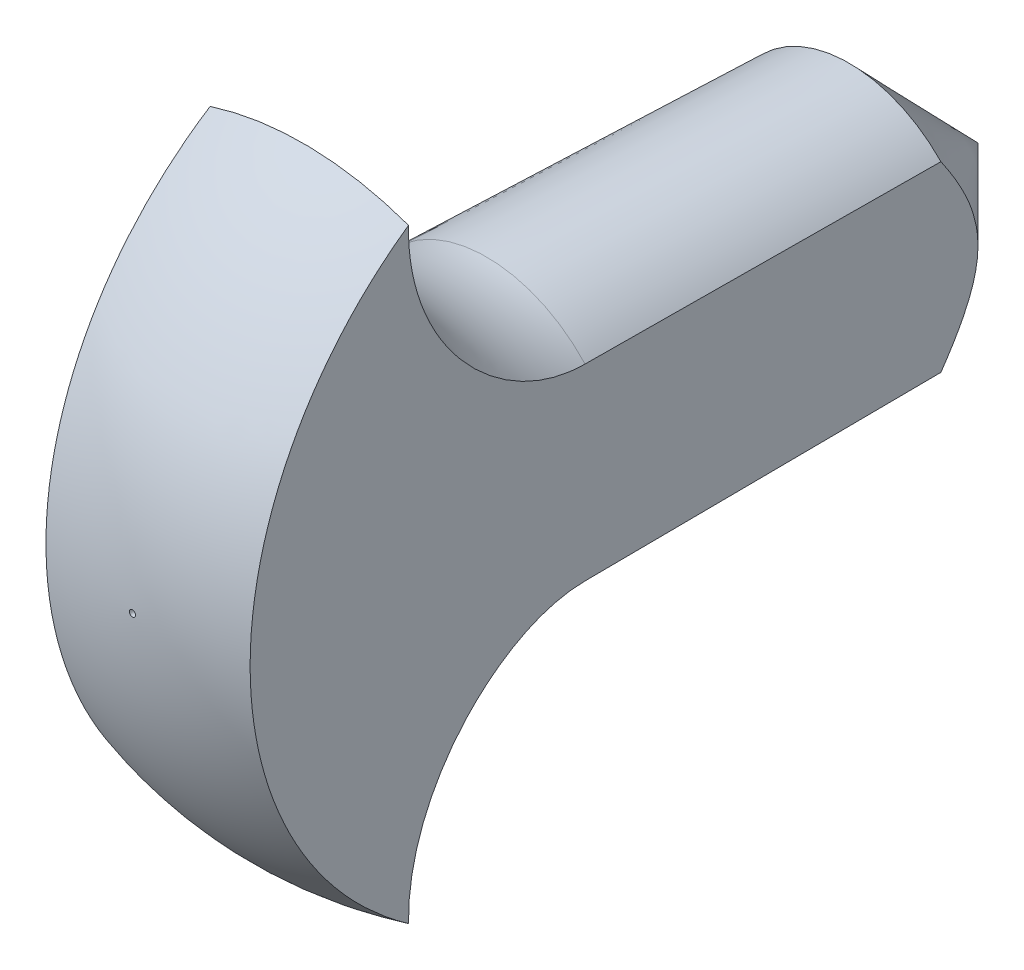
from build123d import *

# Parameters (mm, degrees)
CUT_EXTRUDE_7_DEPTH      = 82.723956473
CUT_EXTRUDE_7_DEPTH_BACK = 82.723956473


with BuildPart() as part:
    # Sketch 6 → Revolve 2 (revolve)
    with BuildSketch(Plane(origin=(0, 0, 0), x_dir=(1, 0, 0), z_dir=(0, 1, 0)), mode=Mode.PRIVATE) as revolve_2_sk:
        with BuildLine():
            Line((17.961101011, -5.064136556), (17.961101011, 40.923698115))
            Line((17.961101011, 40.923698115), (1.589648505, 57.295150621))
            Line((1.589648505, 57.295150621), (0, -28.313811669))
            Line((0, -28.313811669), (0, -50))
            ThreePointArc((0, -50), (23.284215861, -44.247545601), (41.210776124, -28.313811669))
            ThreePointArc((41.210776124, -28.313811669), (24.770773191, -21.504139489), (17.961101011, -5.064136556))
        make_face()
    revolve(revolve_2_sk.sketch.rotate(Axis((1.589648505, 0, -57.295150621), (-0.018565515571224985, 0, 0.9998276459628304)), 180), axis=Axis((1.589648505, 0, -57.295150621), (-0.018565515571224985, 0, 0.9998276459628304)))

    # Sketch 7 → Cut-Extrude 7 (cut, two sides: drawn at the far end of the back side and taken through both)
    with BuildSketch(Plane(origin=(0, 0, 0), x_dir=(1, 0, 0), z_dir=(0, 1, 0)).offset(-CUT_EXTRUDE_7_DEPTH_BACK)):
        with BuildLine():
            Line((13.077175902, 45.807623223), (13.077175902, -48.259584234))
            ThreePointArc((13.077175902, -48.259584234), (28.91805482, -40.789043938), (41.210776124, -28.313811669))
            ThreePointArc((41.210776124, -28.313811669), (24.770773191, -21.504139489), (17.961101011, -5.064136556))
            Line((17.961101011, -5.064136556), (17.961101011, 40.923698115))
            Line((17.961101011, 40.923698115), (13.077175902, 45.807623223))
        make_face()
        with BuildLine():
            Line((-10.316430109, 46.242012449), (-15.378302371, 41.542768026))
            Line((-15.378302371, 41.542768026), (-17.085583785, -4.413364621))
            ThreePointArc((-17.085583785, -4.413364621), (-24.500890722, -20.589227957), (-41.182367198, -26.783876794))
            ThreePointArc((-41.182367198, -26.783876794), (-29.361258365, -39.706871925), (-13.808640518, -47.760349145))
            Line((-13.808640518, -47.760349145), (-10.316430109, 46.242012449))
        make_face()
    extrude(amount=CUT_EXTRUDE_7_DEPTH + CUT_EXTRUDE_7_DEPTH_BACK, mode=Mode.SUBTRACT)


with BuildPart() as cut_extrude_7_kept_piece:
    # of the separate pieces the step leaves, the one the design keeps (cut_extrude_7_pieces_kept)
    add(part.part.solids().sort_by_distance((13.077175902, 39.077392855, 27.791406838))[0])


solid = cut_extrude_7_kept_piece.part
